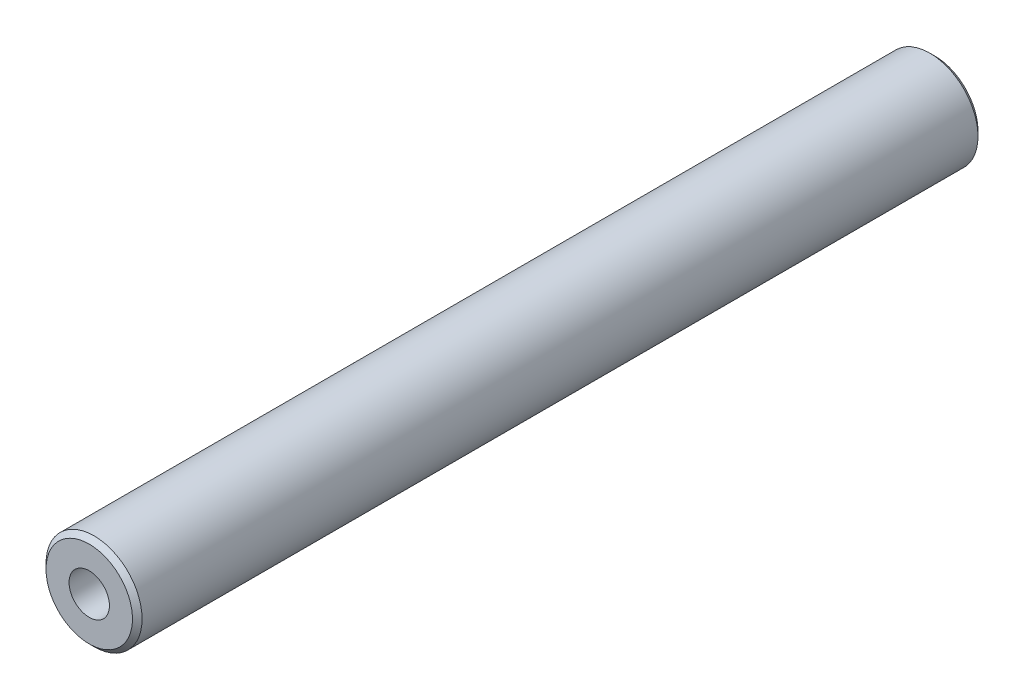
ISO-10303-21;
HEADER;
FILE_DESCRIPTION(('STEP AP214'),'2;1');
FILE_NAME('part.step','',(''),(''),'','','');
FILE_SCHEMA(('AUTOMOTIVE_DESIGN { 1 0 10303 214 1 1 1 1 }'));
ENDSEC;
DATA;
#1=APPLICATION_CONTEXT('core data for automotive mechanical design processes');
#2=APPLICATION_PROTOCOL_DEFINITION('international standard','automotive_design',2000,#1);
#3=PRODUCT_CONTEXT('',#1,'mechanical');
#4=PRODUCT('Part','Part','',(#3));
#5=PRODUCT_RELATED_PRODUCT_CATEGORY('part','',(#4));
#6=PRODUCT_DEFINITION_FORMATION('','',#4);
#7=PRODUCT_DEFINITION_CONTEXT('part definition',#1,'design');
#8=PRODUCT_DEFINITION('design','',#6,#7);
#9=PRODUCT_DEFINITION_SHAPE('','',#8);
#10=(LENGTH_UNIT() NAMED_UNIT(*) SI_UNIT(.MILLI.,.METRE.));
#11=(NAMED_UNIT(*) PLANE_ANGLE_UNIT() SI_UNIT($,.RADIAN.));
#12=(NAMED_UNIT(*) SI_UNIT($,.STERADIAN.) SOLID_ANGLE_UNIT());
#13=UNCERTAINTY_MEASURE_WITH_UNIT(LENGTH_MEASURE(1.E-05),#10,'distance_accuracy_value','');
#14=(GEOMETRIC_REPRESENTATION_CONTEXT(3) GLOBAL_UNCERTAINTY_ASSIGNED_CONTEXT((#13)) GLOBAL_UNIT_ASSIGNED_CONTEXT((#10,
#11,#12)) REPRESENTATION_CONTEXT('',''));
#15=CARTESIAN_POINT('',(0.,0.,0.));
#16=DIRECTION('',(0.,0.,1.));
#17=DIRECTION('',(1.,0.,0.));
#18=AXIS2_PLACEMENT_3D('',#15,#16,#17);
#19=CARTESIAN_POINT('',(0.,4.5,-88.));
#20=DIRECTION('',(0.,0.,1.));
#21=DIRECTION('',(1.,0.,0.));
#22=AXIS2_PLACEMENT_3D('',#19,#20,#21);
#23=PLANE('',#22);
#24=CARTESIAN_POINT('',(0.,0.,-88.0000000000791));
#25=DIRECTION('',(0.,0.,1.));
#26=DIRECTION('',(1.,0.,0.));
#27=AXIS2_PLACEMENT_3D('',#24,#25,#26);
#28=CIRCLE('',#27,4.50000000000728);
#29=CARTESIAN_POINT('',(4.50000000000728,0.,-88.0000000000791));
#30=VERTEX_POINT('',#29);
#31=EDGE_CURVE('E19',#30,#30,#28,.T.);
#32=ORIENTED_EDGE('',*,*,#31,.F.);
#33=EDGE_LOOP('',(#32));
#34=FACE_BOUND('',#33,.T.);
#35=ADVANCED_FACE('F16',(#34),#23,.F.);
#36=CARTESIAN_POINT('',(0.,0.,0.));
#37=DIRECTION('',(0.,0.,-1.));
#38=DIRECTION('',(-1.,0.,0.));
#39=AXIS2_PLACEMENT_3D('',#36,#37,#38);
#40=PLANE('',#39);
#41=CARTESIAN_POINT('',(0.,0.,0.));
#42=DIRECTION('',(0.,0.,1.));
#43=DIRECTION('',(1.,0.,0.));
#44=AXIS2_PLACEMENT_3D('',#41,#42,#43);
#45=CIRCLE('',#44,2.1);
#46=CARTESIAN_POINT('',(2.1,0.,0.));
#47=VERTEX_POINT('',#46);
#48=EDGE_CURVE('E37',#47,#47,#45,.T.);
#49=ORIENTED_EDGE('',*,*,#48,.F.);
#50=EDGE_LOOP('',(#49));
#51=FACE_BOUND('',#50,.T.);
#52=CARTESIAN_POINT('',(0.,0.,0.));
#53=DIRECTION('',(0.,0.,-1.));
#54=DIRECTION('',(-1.,0.,0.));
#55=AXIS2_PLACEMENT_3D('',#52,#53,#54);
#56=CIRCLE('',#55,4.49999999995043);
#57=CARTESIAN_POINT('',(-4.49999999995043,0.,0.));
#58=VERTEX_POINT('',#57);
#59=EDGE_CURVE('E40',#58,#58,#56,.T.);
#60=ORIENTED_EDGE('',*,*,#59,.F.);
#61=EDGE_LOOP('',(#60));
#62=FACE_BOUND('',#61,.T.);
#63=ADVANCED_FACE('F55',(#51,#62),#40,.F.);
#64=CARTESIAN_POINT('',(0.,0.,-87.5000000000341));
#65=DIRECTION('',(0.,0.,1.));
#66=DIRECTION('',(1.,0.,0.));
#67=AXIS2_PLACEMENT_3D('',#64,#65,#66);
#68=CONICAL_SURFACE('',#67,4.99999999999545,0.785398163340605);
#69=CARTESIAN_POINT('',(0.,0.,-87.5));
#70=DIRECTION('',(0.,0.,1.));
#71=DIRECTION('',(1.,0.,0.));
#72=AXIS2_PLACEMENT_3D('',#69,#70,#71);
#73=CIRCLE('',#72,5.);
#74=CARTESIAN_POINT('',(5.,0.,-87.5));
#75=VERTEX_POINT('',#74);
#76=EDGE_CURVE('E23',#75,#75,#73,.T.);
#77=ORIENTED_EDGE('',*,*,#76,.F.);
#78=EDGE_LOOP('',(#77));
#79=FACE_BOUND('',#78,.T.);
#80=ORIENTED_EDGE('',*,*,#31,.T.);
#81=EDGE_LOOP('',(#80));
#82=FACE_BOUND('',#81,.T.);
#83=ADVANCED_FACE('F57',(#79,#82),#68,.T.);
#84=CARTESIAN_POINT('',(0.,0.,-0.499999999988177));
#85=DIRECTION('',(0.,0.,-1.));
#86=DIRECTION('',(-1.,0.,0.));
#87=AXIS2_PLACEMENT_3D('',#84,#85,#86);
#88=CONICAL_SURFACE('',#87,4.99999999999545,0.785398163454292);
#89=ORIENTED_EDGE('',*,*,#59,.T.);
#90=EDGE_LOOP('',(#89));
#91=FACE_BOUND('',#90,.T.);
#92=CARTESIAN_POINT('',(0.,0.,-0.5));
#93=DIRECTION('',(0.,0.,1.));
#94=DIRECTION('',(1.,0.,0.));
#95=AXIS2_PLACEMENT_3D('',#92,#93,#94);
#96=CIRCLE('',#95,5.);
#97=CARTESIAN_POINT('',(5.,0.,-0.5));
#98=VERTEX_POINT('',#97);
#99=EDGE_CURVE('E11',#98,#98,#96,.F.);
#100=ORIENTED_EDGE('',*,*,#99,.F.);
#101=EDGE_LOOP('',(#100));
#102=FACE_BOUND('',#101,.T.);
#103=ADVANCED_FACE('F52',(#91,#102),#88,.T.);
#104=CARTESIAN_POINT('',(0.,0.,-88.));
#105=DIRECTION('',(0.,0.,1.));
#106=DIRECTION('',(1.,0.,0.));
#107=AXIS2_PLACEMENT_3D('',#104,#105,#106);
#108=CYLINDRICAL_SURFACE('',#107,5.);
#109=ORIENTED_EDGE('',*,*,#99,.T.);
#110=EDGE_LOOP('',(#109));
#111=FACE_BOUND('',#110,.T.);
#112=ORIENTED_EDGE('',*,*,#76,.T.);
#113=EDGE_LOOP('',(#112));
#114=FACE_BOUND('',#113,.T.);
#115=ADVANCED_FACE('F31',(#111,#114),#108,.T.);
#116=CARTESIAN_POINT('',(0.,0.,-14.));
#117=DIRECTION('',(0.,0.,1.));
#118=DIRECTION('',(1.,0.,0.));
#119=AXIS2_PLACEMENT_3D('',#116,#117,#118);
#120=CONICAL_SURFACE('',#119,2.1,1.02974425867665);
#121=CARTESIAN_POINT('',(0.,0.,-15.2618072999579));
#122=VERTEX_POINT('',#121);
#123=VERTEX_LOOP('',#122);
#124=FACE_BOUND('',#123,.T.);
#125=CARTESIAN_POINT('',(0.,0.,-14.));
#126=DIRECTION('',(0.,0.,1.));
#127=DIRECTION('',(1.,0.,0.));
#128=AXIS2_PLACEMENT_3D('',#125,#126,#127);
#129=CIRCLE('',#128,2.1);
#130=CARTESIAN_POINT('',(2.1,0.,-14.));
#131=VERTEX_POINT('',#130);
#132=EDGE_CURVE('E35',#131,#131,#129,.T.);
#133=ORIENTED_EDGE('',*,*,#132,.T.);
#134=EDGE_LOOP('',(#133));
#135=FACE_BOUND('',#134,.T.);
#136=ADVANCED_FACE('F27',(#124,#135),#120,.F.);
#137=CARTESIAN_POINT('',(0.,0.,0.));
#138=DIRECTION('',(0.,0.,1.));
#139=DIRECTION('',(1.,0.,0.));
#140=AXIS2_PLACEMENT_3D('',#137,#138,#139);
#141=CYLINDRICAL_SURFACE('',#140,2.1);
#142=ORIENTED_EDGE('',*,*,#132,.F.);
#143=EDGE_LOOP('',(#142));
#144=FACE_BOUND('',#143,.T.);
#145=ORIENTED_EDGE('',*,*,#48,.T.);
#146=EDGE_LOOP('',(#145));
#147=FACE_BOUND('',#146,.T.);
#148=ADVANCED_FACE('F30',(#144,#147),#141,.F.);
#149=CLOSED_SHELL('',(#35,#63,#83,#103,#115,#136,#148));
#150=MANIFOLD_SOLID_BREP('B1',#149);
#151=ADVANCED_BREP_SHAPE_REPRESENTATION('',(#18,#150),#14);
#152=SHAPE_DEFINITION_REPRESENTATION(#9,#151);
ENDSEC;
END-ISO-10303-21;
